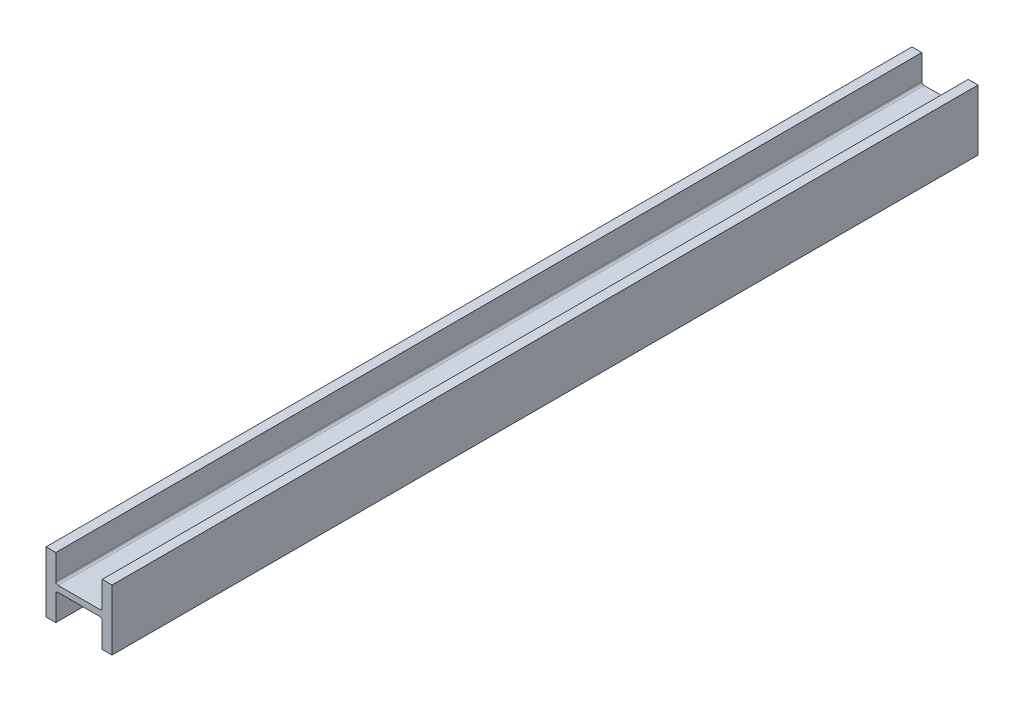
ISO-10303-21;
HEADER;
FILE_DESCRIPTION(('STEP AP214'),'2;1');
FILE_NAME('part.step','',(''),(''),'','','');
FILE_SCHEMA(('AUTOMOTIVE_DESIGN { 1 0 10303 214 1 1 1 1 }'));
ENDSEC;
DATA;
#1=APPLICATION_CONTEXT('core data for automotive mechanical design processes');
#2=APPLICATION_PROTOCOL_DEFINITION('international standard','automotive_design',2000,#1);
#3=PRODUCT_CONTEXT('',#1,'mechanical');
#4=PRODUCT('Part','Part','',(#3));
#5=PRODUCT_RELATED_PRODUCT_CATEGORY('part','',(#4));
#6=PRODUCT_DEFINITION_FORMATION('','',#4);
#7=PRODUCT_DEFINITION_CONTEXT('part definition',#1,'design');
#8=PRODUCT_DEFINITION('design','',#6,#7);
#9=PRODUCT_DEFINITION_SHAPE('','',#8);
#10=(LENGTH_UNIT() NAMED_UNIT(*) SI_UNIT(.MILLI.,.METRE.));
#11=(NAMED_UNIT(*) PLANE_ANGLE_UNIT() SI_UNIT($,.RADIAN.));
#12=(NAMED_UNIT(*) SI_UNIT($,.STERADIAN.) SOLID_ANGLE_UNIT());
#13=UNCERTAINTY_MEASURE_WITH_UNIT(LENGTH_MEASURE(1.E-05),#10,'distance_accuracy_value','');
#14=(GEOMETRIC_REPRESENTATION_CONTEXT(3) GLOBAL_UNCERTAINTY_ASSIGNED_CONTEXT((#13)) GLOBAL_UNIT_ASSIGNED_CONTEXT((#10,
#11,#12)) REPRESENTATION_CONTEXT('',''));
#15=CARTESIAN_POINT('',(0.,0.,0.));
#16=DIRECTION('',(0.,0.,1.));
#17=DIRECTION('',(1.,0.,0.));
#18=AXIS2_PLACEMENT_3D('',#15,#16,#17);
#19=CARTESIAN_POINT('',(227.584,209.2325,2984.5));
#20=DIRECTION('',(-1.,0.,0.));
#21=DIRECTION('',(0.,0.,1.));
#22=AXIS2_PLACEMENT_3D('',#19,#20,#21);
#23=PLANE('',#22);
#24=DIRECTION('',(0.,1.,0.));
#25=VECTOR('',#24,1.);
#26=CARTESIAN_POINT('',(227.584,209.2325,-2984.5));
#27=LINE('',#26,#25);
#28=CARTESIAN_POINT('',(227.584,-209.2325,-2984.5));
#29=VERTEX_POINT('',#28);
#30=CARTESIAN_POINT('',(227.584,209.2325,-2984.5));
#31=VERTEX_POINT('',#30);
#32=EDGE_CURVE('E193',#29,#31,#27,.T.);
#33=ORIENTED_EDGE('',*,*,#32,.T.);
#34=DIRECTION('',(0.,0.,-1.));
#35=VECTOR('',#34,1.);
#36=CARTESIAN_POINT('',(227.584,209.2325,2984.5));
#37=LINE('',#36,#35);
#38=CARTESIAN_POINT('',(227.584,209.2325,2984.5));
#39=VERTEX_POINT('',#38);
#40=EDGE_CURVE('E11',#39,#31,#37,.T.);
#41=ORIENTED_EDGE('',*,*,#40,.F.);
#42=DIRECTION('',(0.,1.,0.));
#43=VECTOR('',#42,1.);
#44=CARTESIAN_POINT('',(227.584,209.2325,2984.5));
#45=LINE('',#44,#43);
#46=CARTESIAN_POINT('',(227.584,-209.2325,2984.5));
#47=VERTEX_POINT('',#46);
#48=EDGE_CURVE('E238',#47,#39,#45,.T.);
#49=ORIENTED_EDGE('',*,*,#48,.F.);
#50=DIRECTION('',(0.,0.,-1.));
#51=VECTOR('',#50,1.);
#52=CARTESIAN_POINT('',(227.584,-209.2325,2984.5));
#53=LINE('',#52,#51);
#54=EDGE_CURVE('E190',#47,#29,#53,.T.);
#55=ORIENTED_EDGE('',*,*,#54,.T.);
#56=EDGE_LOOP('',(#33,#41,#49,#55));
#57=FACE_BOUND('',#56,.T.);
#58=ADVANCED_FACE('F44',(#57),#23,.F.);
#59=CARTESIAN_POINT('',(160.02,209.2325,2984.5));
#60=DIRECTION('',(0.,-1.,0.));
#61=DIRECTION('',(0.,0.,-1.));
#62=AXIS2_PLACEMENT_3D('',#59,#60,#61);
#63=PLANE('',#62);
#64=DIRECTION('',(-1.,0.,0.));
#65=VECTOR('',#64,1.);
#66=CARTESIAN_POINT('',(160.02,209.2325,-2984.5));
#67=LINE('',#66,#65);
#68=CARTESIAN_POINT('',(160.02,209.2325,-2984.5));
#69=VERTEX_POINT('',#68);
#70=EDGE_CURVE('E196',#31,#69,#67,.T.);
#71=ORIENTED_EDGE('',*,*,#70,.T.);
#72=DIRECTION('',(0.,0.,-1.));
#73=VECTOR('',#72,1.);
#74=CARTESIAN_POINT('',(160.02,209.2325,2984.5));
#75=LINE('',#74,#73);
#76=CARTESIAN_POINT('',(160.02,209.2325,2984.5));
#77=VERTEX_POINT('',#76);
#78=EDGE_CURVE('E53',#77,#69,#75,.T.);
#79=ORIENTED_EDGE('',*,*,#78,.F.);
#80=DIRECTION('',(-1.,0.,0.));
#81=VECTOR('',#80,1.);
#82=CARTESIAN_POINT('',(160.02,209.2325,2984.5));
#83=LINE('',#82,#81);
#84=EDGE_CURVE('E129',#39,#77,#83,.T.);
#85=ORIENTED_EDGE('',*,*,#84,.F.);
#86=ORIENTED_EDGE('',*,*,#40,.T.);
#87=EDGE_LOOP('',(#71,#79,#85,#86));
#88=FACE_BOUND('',#87,.T.);
#89=ADVANCED_FACE('F362',(#88),#63,.F.);
#90=CARTESIAN_POINT('',(160.02,36.2585000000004,2984.5));
#91=DIRECTION('',(1.,0.,0.));
#92=DIRECTION('',(0.,0.,-1.));
#93=AXIS2_PLACEMENT_3D('',#90,#91,#92);
#94=PLANE('',#93);
#95=DIRECTION('',(0.,-1.,0.));
#96=VECTOR('',#95,1.);
#97=CARTESIAN_POINT('',(160.02,36.2585000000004,-2984.5));
#98=LINE('',#97,#96);
#99=CARTESIAN_POINT('',(160.02,36.2585000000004,-2984.5));
#100=VERTEX_POINT('',#99);
#101=EDGE_CURVE('E203',#69,#100,#98,.T.);
#102=ORIENTED_EDGE('',*,*,#101,.T.);
#103=DIRECTION('',(0.,0.,-1.));
#104=VECTOR('',#103,1.);
#105=CARTESIAN_POINT('',(160.02,36.2585000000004,2984.5));
#106=LINE('',#105,#104);
#107=CARTESIAN_POINT('',(160.02,36.2585000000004,2984.5));
#108=VERTEX_POINT('',#107);
#109=EDGE_CURVE('E284',#108,#100,#106,.T.);
#110=ORIENTED_EDGE('',*,*,#109,.F.);
#111=DIRECTION('',(0.,-1.,0.));
#112=VECTOR('',#111,1.);
#113=CARTESIAN_POINT('',(160.02,36.2585000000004,2984.5));
#114=LINE('',#113,#112);
#115=EDGE_CURVE('E291',#77,#108,#114,.T.);
#116=ORIENTED_EDGE('',*,*,#115,.F.);
#117=ORIENTED_EDGE('',*,*,#78,.T.);
#118=EDGE_LOOP('',(#102,#110,#116,#117));
#119=FACE_BOUND('',#118,.T.);
#120=ADVANCED_FACE('F292',(#119),#94,.F.);
#121=CARTESIAN_POINT('',(144.78,36.2585000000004,2984.5));
#122=DIRECTION('',(0.,0.,-1.));
#123=DIRECTION('',(-1.,0.,0.));
#124=AXIS2_PLACEMENT_3D('',#121,#122,#123);
#125=CYLINDRICAL_SURFACE('',#124,15.24);
#126=CARTESIAN_POINT('',(144.78,36.2585000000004,-2984.5));
#127=DIRECTION('',(0.,0.,-1.));
#128=DIRECTION('',(1.,0.,0.));
#129=AXIS2_PLACEMENT_3D('',#126,#127,#128);
#130=CIRCLE('',#129,15.24);
#131=CARTESIAN_POINT('',(144.78,21.0185000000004,-2984.5));
#132=VERTEX_POINT('',#131);
#133=EDGE_CURVE('E204',#100,#132,#130,.T.);
#134=ORIENTED_EDGE('',*,*,#133,.T.);
#135=DIRECTION('',(0.,0.,-1.));
#136=VECTOR('',#135,1.);
#137=CARTESIAN_POINT('',(144.78,21.0185000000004,2984.5));
#138=LINE('',#137,#136);
#139=CARTESIAN_POINT('',(144.78,21.0185000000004,2984.5));
#140=VERTEX_POINT('',#139);
#141=EDGE_CURVE('E276',#140,#132,#138,.T.);
#142=ORIENTED_EDGE('',*,*,#141,.F.);
#143=CARTESIAN_POINT('',(144.78,36.2585000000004,2984.5));
#144=DIRECTION('',(0.,0.,-1.));
#145=DIRECTION('',(1.,0.,0.));
#146=AXIS2_PLACEMENT_3D('',#143,#144,#145);
#147=CIRCLE('',#146,15.24);
#148=EDGE_CURVE('E315',#108,#140,#147,.T.);
#149=ORIENTED_EDGE('',*,*,#148,.F.);
#150=ORIENTED_EDGE('',*,*,#109,.T.);
#151=EDGE_LOOP('',(#134,#142,#149,#150));
#152=FACE_BOUND('',#151,.T.);
#153=ADVANCED_FACE('F301',(#152),#125,.F.);
#154=CARTESIAN_POINT('',(-144.78,21.0185000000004,2984.5));
#155=DIRECTION('',(0.,-1.,0.));
#156=DIRECTION('',(0.,0.,-1.));
#157=AXIS2_PLACEMENT_3D('',#154,#155,#156);
#158=PLANE('',#157);
#159=DIRECTION('',(-1.,0.,0.));
#160=VECTOR('',#159,1.);
#161=CARTESIAN_POINT('',(-144.78,21.0185000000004,-2984.5));
#162=LINE('',#161,#160);
#163=CARTESIAN_POINT('',(-144.78,21.0185000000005,-2984.5));
#164=VERTEX_POINT('',#163);
#165=EDGE_CURVE('E210',#132,#164,#162,.T.);
#166=ORIENTED_EDGE('',*,*,#165,.T.);
#167=DIRECTION('',(0.,0.,-1.));
#168=VECTOR('',#167,1.);
#169=CARTESIAN_POINT('',(-144.78,21.0185000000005,2984.5));
#170=LINE('',#169,#168);
#171=CARTESIAN_POINT('',(-144.78,21.0185000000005,2984.5));
#172=VERTEX_POINT('',#171);
#173=EDGE_CURVE('E274',#172,#164,#170,.T.);
#174=ORIENTED_EDGE('',*,*,#173,.F.);
#175=DIRECTION('',(-1.,0.,0.));
#176=VECTOR('',#175,1.);
#177=CARTESIAN_POINT('',(-144.78,21.0185000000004,2984.5));
#178=LINE('',#177,#176);
#179=EDGE_CURVE('E306',#140,#172,#178,.T.);
#180=ORIENTED_EDGE('',*,*,#179,.F.);
#181=ORIENTED_EDGE('',*,*,#141,.T.);
#182=EDGE_LOOP('',(#166,#174,#180,#181));
#183=FACE_BOUND('',#182,.T.);
#184=ADVANCED_FACE('F308',(#183),#158,.F.);
#185=CARTESIAN_POINT('',(-144.78,36.2585000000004,2984.5));
#186=DIRECTION('',(0.,0.,-1.));
#187=DIRECTION('',(-1.,0.,0.));
#188=AXIS2_PLACEMENT_3D('',#185,#186,#187);
#189=CYLINDRICAL_SURFACE('',#188,15.24);
#190=CARTESIAN_POINT('',(-144.78,36.2585000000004,-2984.5));
#191=DIRECTION('',(0.,0.,-1.));
#192=DIRECTION('',(1.,0.,0.));
#193=AXIS2_PLACEMENT_3D('',#190,#191,#192);
#194=CIRCLE('',#193,15.24);
#195=CARTESIAN_POINT('',(-160.02,36.2585000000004,-2984.5));
#196=VERTEX_POINT('',#195);
#197=EDGE_CURVE('E209',#164,#196,#194,.T.);
#198=ORIENTED_EDGE('',*,*,#197,.T.);
#199=DIRECTION('',(0.,0.,-1.));
#200=VECTOR('',#199,1.);
#201=CARTESIAN_POINT('',(-160.02,36.2585000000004,2984.5));
#202=LINE('',#201,#200);
#203=CARTESIAN_POINT('',(-160.02,36.2585000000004,2984.5));
#204=VERTEX_POINT('',#203);
#205=EDGE_CURVE('E271',#204,#196,#202,.T.);
#206=ORIENTED_EDGE('',*,*,#205,.F.);
#207=CARTESIAN_POINT('',(-144.78,36.2585000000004,2984.5));
#208=DIRECTION('',(0.,0.,-1.));
#209=DIRECTION('',(1.,0.,0.));
#210=AXIS2_PLACEMENT_3D('',#207,#208,#209);
#211=CIRCLE('',#210,15.24);
#212=EDGE_CURVE('E313',#172,#204,#211,.T.);
#213=ORIENTED_EDGE('',*,*,#212,.F.);
#214=ORIENTED_EDGE('',*,*,#173,.T.);
#215=EDGE_LOOP('',(#198,#206,#213,#214));
#216=FACE_BOUND('',#215,.T.);
#217=ADVANCED_FACE('F374',(#216),#189,.F.);
#218=CARTESIAN_POINT('',(-160.02,209.2325,2984.5));
#219=DIRECTION('',(-1.,0.,0.));
#220=DIRECTION('',(0.,0.,1.));
#221=AXIS2_PLACEMENT_3D('',#218,#219,#220);
#222=PLANE('',#221);
#223=DIRECTION('',(0.,1.,0.));
#224=VECTOR('',#223,1.);
#225=CARTESIAN_POINT('',(-160.02,209.2325,-2984.5));
#226=LINE('',#225,#224);
#227=CARTESIAN_POINT('',(-160.02,209.2325,-2984.5));
#228=VERTEX_POINT('',#227);
#229=EDGE_CURVE('E213',#196,#228,#226,.T.);
#230=ORIENTED_EDGE('',*,*,#229,.T.);
#231=DIRECTION('',(0.,0.,-1.));
#232=VECTOR('',#231,1.);
#233=CARTESIAN_POINT('',(-160.02,209.2325,2984.5));
#234=LINE('',#233,#232);
#235=CARTESIAN_POINT('',(-160.02,209.2325,2984.5));
#236=VERTEX_POINT('',#235);
#237=EDGE_CURVE('E270',#236,#228,#234,.T.);
#238=ORIENTED_EDGE('',*,*,#237,.F.);
#239=DIRECTION('',(0.,1.,0.));
#240=VECTOR('',#239,1.);
#241=CARTESIAN_POINT('',(-160.02,209.2325,2984.5));
#242=LINE('',#241,#240);
#243=EDGE_CURVE('E316',#204,#236,#242,.T.);
#244=ORIENTED_EDGE('',*,*,#243,.F.);
#245=ORIENTED_EDGE('',*,*,#205,.T.);
#246=EDGE_LOOP('',(#230,#238,#244,#245));
#247=FACE_BOUND('',#246,.T.);
#248=ADVANCED_FACE('F378',(#247),#222,.F.);
#249=CARTESIAN_POINT('',(-227.584,209.2325,2984.5));
#250=DIRECTION('',(0.,-1.,0.));
#251=DIRECTION('',(0.,0.,-1.));
#252=AXIS2_PLACEMENT_3D('',#249,#250,#251);
#253=PLANE('',#252);
#254=DIRECTION('',(-1.,0.,0.));
#255=VECTOR('',#254,1.);
#256=CARTESIAN_POINT('',(-227.584,209.2325,-2984.5));
#257=LINE('',#256,#255);
#258=CARTESIAN_POINT('',(-227.584,209.2325,-2984.5));
#259=VERTEX_POINT('',#258);
#260=EDGE_CURVE('E216',#228,#259,#257,.T.);
#261=ORIENTED_EDGE('',*,*,#260,.T.);
#262=DIRECTION('',(0.,0.,-1.));
#263=VECTOR('',#262,1.);
#264=CARTESIAN_POINT('',(-227.584,209.2325,2984.5));
#265=LINE('',#264,#263);
#266=CARTESIAN_POINT('',(-227.584,209.2325,2984.5));
#267=VERTEX_POINT('',#266);
#268=EDGE_CURVE('E263',#267,#259,#265,.T.);
#269=ORIENTED_EDGE('',*,*,#268,.F.);
#270=DIRECTION('',(-1.,0.,0.));
#271=VECTOR('',#270,1.);
#272=CARTESIAN_POINT('',(-227.584,209.2325,2984.5));
#273=LINE('',#272,#271);
#274=EDGE_CURVE('E323',#236,#267,#273,.T.);
#275=ORIENTED_EDGE('',*,*,#274,.F.);
#276=ORIENTED_EDGE('',*,*,#237,.T.);
#277=EDGE_LOOP('',(#261,#269,#275,#276));
#278=FACE_BOUND('',#277,.T.);
#279=ADVANCED_FACE('F385',(#278),#253,.F.);
#280=CARTESIAN_POINT('',(-227.584,-209.2325,2984.5));
#281=DIRECTION('',(1.,0.,0.));
#282=DIRECTION('',(0.,0.,-1.));
#283=AXIS2_PLACEMENT_3D('',#280,#281,#282);
#284=PLANE('',#283);
#285=DIRECTION('',(0.,-1.,0.));
#286=VECTOR('',#285,1.);
#287=CARTESIAN_POINT('',(-227.584,-209.2325,-2984.5));
#288=LINE('',#287,#286);
#289=CARTESIAN_POINT('',(-227.584,-209.2325,-2984.5));
#290=VERTEX_POINT('',#289);
#291=EDGE_CURVE('E218',#259,#290,#288,.T.);
#292=ORIENTED_EDGE('',*,*,#291,.T.);
#293=DIRECTION('',(0.,0.,-1.));
#294=VECTOR('',#293,1.);
#295=CARTESIAN_POINT('',(-227.584,-209.2325,2984.5));
#296=LINE('',#295,#294);
#297=CARTESIAN_POINT('',(-227.584,-209.2325,2984.5));
#298=VERTEX_POINT('',#297);
#299=EDGE_CURVE('E259',#298,#290,#296,.T.);
#300=ORIENTED_EDGE('',*,*,#299,.F.);
#301=DIRECTION('',(0.,-1.,0.));
#302=VECTOR('',#301,1.);
#303=CARTESIAN_POINT('',(-227.584,-209.2325,2984.5));
#304=LINE('',#303,#302);
#305=EDGE_CURVE('E326',#267,#298,#304,.T.);
#306=ORIENTED_EDGE('',*,*,#305,.F.);
#307=ORIENTED_EDGE('',*,*,#268,.T.);
#308=EDGE_LOOP('',(#292,#300,#306,#307));
#309=FACE_BOUND('',#308,.T.);
#310=ADVANCED_FACE('F387',(#309),#284,.F.);
#311=CARTESIAN_POINT('',(-160.02,-209.2325,2984.5));
#312=DIRECTION('',(0.,1.,0.));
#313=DIRECTION('',(0.,0.,1.));
#314=AXIS2_PLACEMENT_3D('',#311,#312,#313);
#315=PLANE('',#314);
#316=DIRECTION('',(1.,0.,0.));
#317=VECTOR('',#316,1.);
#318=CARTESIAN_POINT('',(-160.02,-209.2325,-2984.5));
#319=LINE('',#318,#317);
#320=CARTESIAN_POINT('',(-160.02,-209.2325,-2984.5));
#321=VERTEX_POINT('',#320);
#322=EDGE_CURVE('E225',#290,#321,#319,.T.);
#323=ORIENTED_EDGE('',*,*,#322,.T.);
#324=DIRECTION('',(0.,0.,-1.));
#325=VECTOR('',#324,1.);
#326=CARTESIAN_POINT('',(-160.02,-209.2325,2984.5));
#327=LINE('',#326,#325);
#328=CARTESIAN_POINT('',(-160.02,-209.2325,2984.5));
#329=VERTEX_POINT('',#328);
#330=EDGE_CURVE('E254',#329,#321,#327,.T.);
#331=ORIENTED_EDGE('',*,*,#330,.F.);
#332=DIRECTION('',(1.,0.,0.));
#333=VECTOR('',#332,1.);
#334=CARTESIAN_POINT('',(-160.02,-209.2325,2984.5));
#335=LINE('',#334,#333);
#336=EDGE_CURVE('E328',#298,#329,#335,.T.);
#337=ORIENTED_EDGE('',*,*,#336,.F.);
#338=ORIENTED_EDGE('',*,*,#299,.T.);
#339=EDGE_LOOP('',(#323,#331,#337,#338));
#340=FACE_BOUND('',#339,.T.);
#341=ADVANCED_FACE('F388',(#340),#315,.F.);
#342=CARTESIAN_POINT('',(-160.02,-36.2584999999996,2984.5));
#343=DIRECTION('',(-1.,0.,0.));
#344=DIRECTION('',(0.,0.,1.));
#345=AXIS2_PLACEMENT_3D('',#342,#343,#344);
#346=PLANE('',#345);
#347=DIRECTION('',(0.,1.,0.));
#348=VECTOR('',#347,1.);
#349=CARTESIAN_POINT('',(-160.02,-36.2584999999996,-2984.5));
#350=LINE('',#349,#348);
#351=CARTESIAN_POINT('',(-160.02,-36.2584999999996,-2984.5));
#352=VERTEX_POINT('',#351);
#353=EDGE_CURVE('E223',#321,#352,#350,.T.);
#354=ORIENTED_EDGE('',*,*,#353,.T.);
#355=DIRECTION('',(0.,0.,-1.));
#356=VECTOR('',#355,1.);
#357=CARTESIAN_POINT('',(-160.02,-36.2584999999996,2984.5));
#358=LINE('',#357,#356);
#359=CARTESIAN_POINT('',(-160.02,-36.2584999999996,2984.5));
#360=VERTEX_POINT('',#359);
#361=EDGE_CURVE('E253',#360,#352,#358,.T.);
#362=ORIENTED_EDGE('',*,*,#361,.F.);
#363=DIRECTION('',(0.,1.,0.));
#364=VECTOR('',#363,1.);
#365=CARTESIAN_POINT('',(-160.02,-36.2584999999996,2984.5));
#366=LINE('',#365,#364);
#367=EDGE_CURVE('E335',#329,#360,#366,.T.);
#368=ORIENTED_EDGE('',*,*,#367,.F.);
#369=ORIENTED_EDGE('',*,*,#330,.T.);
#370=EDGE_LOOP('',(#354,#362,#368,#369));
#371=FACE_BOUND('',#370,.T.);
#372=ADVANCED_FACE('F393',(#371),#346,.F.);
#373=CARTESIAN_POINT('',(-144.78,-36.2584999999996,2984.5));
#374=DIRECTION('',(0.,0.,-1.));
#375=DIRECTION('',(-1.,0.,0.));
#376=AXIS2_PLACEMENT_3D('',#373,#374,#375);
#377=CYLINDRICAL_SURFACE('',#376,15.24);
#378=CARTESIAN_POINT('',(-144.78,-36.2584999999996,-2984.5));
#379=DIRECTION('',(0.,0.,-1.));
#380=DIRECTION('',(1.,0.,0.));
#381=AXIS2_PLACEMENT_3D('',#378,#379,#380);
#382=CIRCLE('',#381,15.24);
#383=CARTESIAN_POINT('',(-144.78,-21.0184999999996,-2984.5));
#384=VERTEX_POINT('',#383);
#385=EDGE_CURVE('E229',#352,#384,#382,.T.);
#386=ORIENTED_EDGE('',*,*,#385,.T.);
#387=DIRECTION('',(0.,0.,-1.));
#388=VECTOR('',#387,1.);
#389=CARTESIAN_POINT('',(-144.78,-21.0184999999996,2984.5));
#390=LINE('',#389,#388);
#391=CARTESIAN_POINT('',(-144.78,-21.0184999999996,2984.5));
#392=VERTEX_POINT('',#391);
#393=EDGE_CURVE('E246',#392,#384,#390,.T.);
#394=ORIENTED_EDGE('',*,*,#393,.F.);
#395=CARTESIAN_POINT('',(-144.78,-36.2584999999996,2984.5));
#396=DIRECTION('',(0.,0.,-1.));
#397=DIRECTION('',(1.,0.,0.));
#398=AXIS2_PLACEMENT_3D('',#395,#396,#397);
#399=CIRCLE('',#398,15.24);
#400=EDGE_CURVE('E333',#360,#392,#399,.T.);
#401=ORIENTED_EDGE('',*,*,#400,.F.);
#402=ORIENTED_EDGE('',*,*,#361,.T.);
#403=EDGE_LOOP('',(#386,#394,#401,#402));
#404=FACE_BOUND('',#403,.T.);
#405=ADVANCED_FACE('F345',(#404),#377,.F.);
#406=CARTESIAN_POINT('',(144.78,-21.0184999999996,2984.5));
#407=DIRECTION('',(0.,1.,0.));
#408=DIRECTION('',(-1.,0.,0.));
#409=AXIS2_PLACEMENT_3D('',#406,#407,#408);
#410=PLANE('',#409);
#411=DIRECTION('',(1.,0.,0.));
#412=VECTOR('',#411,1.);
#413=CARTESIAN_POINT('',(144.78,-21.0184999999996,-2984.5));
#414=LINE('',#413,#412);
#415=CARTESIAN_POINT('',(144.78,-21.0184999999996,-2984.5));
#416=VERTEX_POINT('',#415);
#417=EDGE_CURVE('E234',#384,#416,#414,.T.);
#418=ORIENTED_EDGE('',*,*,#417,.T.);
#419=DIRECTION('',(0.,0.,-1.));
#420=VECTOR('',#419,1.);
#421=CARTESIAN_POINT('',(144.78,-21.0184999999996,2984.5));
#422=LINE('',#421,#420);
#423=CARTESIAN_POINT('',(144.78,-21.0184999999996,2984.5));
#424=VERTEX_POINT('',#423);
#425=EDGE_CURVE('E181',#424,#416,#422,.T.);
#426=ORIENTED_EDGE('',*,*,#425,.F.);
#427=DIRECTION('',(1.,0.,0.));
#428=VECTOR('',#427,1.);
#429=CARTESIAN_POINT('',(144.78,-21.0184999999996,2984.5));
#430=LINE('',#429,#428);
#431=EDGE_CURVE('E172',#392,#424,#430,.T.);
#432=ORIENTED_EDGE('',*,*,#431,.F.);
#433=ORIENTED_EDGE('',*,*,#393,.T.);
#434=EDGE_LOOP('',(#418,#426,#432,#433));
#435=FACE_BOUND('',#434,.T.);
#436=ADVANCED_FACE('F350',(#435),#410,.F.);
#437=CARTESIAN_POINT('',(144.78,-36.2584999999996,2984.5));
#438=DIRECTION('',(0.,0.,-1.));
#439=DIRECTION('',(-1.,0.,0.));
#440=AXIS2_PLACEMENT_3D('',#437,#438,#439);
#441=CYLINDRICAL_SURFACE('',#440,15.24);
#442=CARTESIAN_POINT('',(144.78,-36.2584999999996,-2984.5));
#443=DIRECTION('',(0.,0.,-1.));
#444=DIRECTION('',(1.,0.,0.));
#445=AXIS2_PLACEMENT_3D('',#442,#443,#444);
#446=CIRCLE('',#445,15.24);
#447=CARTESIAN_POINT('',(160.02,-36.2584999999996,-2984.5));
#448=VERTEX_POINT('',#447);
#449=EDGE_CURVE('E182',#416,#448,#446,.T.);
#450=ORIENTED_EDGE('',*,*,#449,.T.);
#451=DIRECTION('',(0.,0.,-1.));
#452=VECTOR('',#451,1.);
#453=CARTESIAN_POINT('',(160.02,-36.2584999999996,2984.5));
#454=LINE('',#453,#452);
#455=CARTESIAN_POINT('',(160.02,-36.2584999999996,2984.5));
#456=VERTEX_POINT('',#455);
#457=EDGE_CURVE('E180',#456,#448,#454,.T.);
#458=ORIENTED_EDGE('',*,*,#457,.F.);
#459=CARTESIAN_POINT('',(144.78,-36.2584999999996,2984.5));
#460=DIRECTION('',(0.,0.,-1.));
#461=DIRECTION('',(1.,0.,0.));
#462=AXIS2_PLACEMENT_3D('',#459,#460,#461);
#463=CIRCLE('',#462,15.24);
#464=EDGE_CURVE('E167',#424,#456,#463,.T.);
#465=ORIENTED_EDGE('',*,*,#464,.F.);
#466=ORIENTED_EDGE('',*,*,#425,.T.);
#467=EDGE_LOOP('',(#450,#458,#465,#466));
#468=FACE_BOUND('',#467,.T.);
#469=ADVANCED_FACE('F178',(#468),#441,.F.);
#470=CARTESIAN_POINT('',(160.02,-209.2325,2984.5));
#471=DIRECTION('',(1.,0.,0.));
#472=DIRECTION('',(0.,0.,-1.));
#473=AXIS2_PLACEMENT_3D('',#470,#471,#472);
#474=PLANE('',#473);
#475=DIRECTION('',(0.,-1.,0.));
#476=VECTOR('',#475,1.);
#477=CARTESIAN_POINT('',(160.02,-209.2325,-2984.5));
#478=LINE('',#477,#476);
#479=CARTESIAN_POINT('',(160.02,-209.2325,-2984.5));
#480=VERTEX_POINT('',#479);
#481=EDGE_CURVE('E113',#448,#480,#478,.T.);
#482=ORIENTED_EDGE('',*,*,#481,.T.);
#483=DIRECTION('',(0.,0.,-1.));
#484=VECTOR('',#483,1.);
#485=CARTESIAN_POINT('',(160.02,-209.2325,2984.5));
#486=LINE('',#485,#484);
#487=CARTESIAN_POINT('',(160.02,-209.2325,2984.5));
#488=VERTEX_POINT('',#487);
#489=EDGE_CURVE('E184',#488,#480,#486,.T.);
#490=ORIENTED_EDGE('',*,*,#489,.F.);
#491=DIRECTION('',(0.,-1.,0.));
#492=VECTOR('',#491,1.);
#493=CARTESIAN_POINT('',(160.02,-209.2325,2984.5));
#494=LINE('',#493,#492);
#495=EDGE_CURVE('E168',#456,#488,#494,.T.);
#496=ORIENTED_EDGE('',*,*,#495,.F.);
#497=ORIENTED_EDGE('',*,*,#457,.T.);
#498=EDGE_LOOP('',(#482,#490,#496,#497));
#499=FACE_BOUND('',#498,.T.);
#500=ADVANCED_FACE('F186',(#499),#474,.F.);
#501=CARTESIAN_POINT('',(227.584,-209.2325,2984.5));
#502=DIRECTION('',(0.,1.,0.));
#503=DIRECTION('',(0.,0.,1.));
#504=AXIS2_PLACEMENT_3D('',#501,#502,#503);
#505=PLANE('',#504);
#506=DIRECTION('',(1.,0.,0.));
#507=VECTOR('',#506,1.);
#508=CARTESIAN_POINT('',(227.584,-209.2325,-2984.5));
#509=LINE('',#508,#507);
#510=EDGE_CURVE('E124',#480,#29,#509,.T.);
#511=ORIENTED_EDGE('',*,*,#510,.T.);
#512=ORIENTED_EDGE('',*,*,#54,.F.);
#513=DIRECTION('',(1.,0.,0.));
#514=VECTOR('',#513,1.);
#515=CARTESIAN_POINT('',(227.584,-209.2325,2984.5));
#516=LINE('',#515,#514);
#517=EDGE_CURVE('E62',#488,#47,#516,.T.);
#518=ORIENTED_EDGE('',*,*,#517,.F.);
#519=ORIENTED_EDGE('',*,*,#489,.T.);
#520=EDGE_LOOP('',(#511,#512,#518,#519));
#521=FACE_BOUND('',#520,.T.);
#522=ADVANCED_FACE('F351',(#521),#505,.F.);
#523=CARTESIAN_POINT('',(144.78,-36.2584999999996,2984.5));
#524=DIRECTION('',(0.,0.,1.));
#525=DIRECTION('',(1.,0.,0.));
#526=AXIS2_PLACEMENT_3D('',#523,#524,#525);
#527=PLANE('',#526);
#528=ORIENTED_EDGE('',*,*,#48,.T.);
#529=ORIENTED_EDGE('',*,*,#84,.T.);
#530=ORIENTED_EDGE('',*,*,#115,.T.);
#531=ORIENTED_EDGE('',*,*,#148,.T.);
#532=ORIENTED_EDGE('',*,*,#179,.T.);
#533=ORIENTED_EDGE('',*,*,#212,.T.);
#534=ORIENTED_EDGE('',*,*,#243,.T.);
#535=ORIENTED_EDGE('',*,*,#274,.T.);
#536=ORIENTED_EDGE('',*,*,#305,.T.);
#537=ORIENTED_EDGE('',*,*,#336,.T.);
#538=ORIENTED_EDGE('',*,*,#367,.T.);
#539=ORIENTED_EDGE('',*,*,#400,.T.);
#540=ORIENTED_EDGE('',*,*,#431,.T.);
#541=ORIENTED_EDGE('',*,*,#464,.T.);
#542=ORIENTED_EDGE('',*,*,#495,.T.);
#543=ORIENTED_EDGE('',*,*,#517,.T.);
#544=EDGE_LOOP('',(#528,#529,#530,#531,#532,#533,#534,#535,#536,#537,#538,#539,#540,#541,#542,#543));
#545=FACE_BOUND('',#544,.T.);
#546=ADVANCED_FACE('F169',(#545),#527,.T.);
#547=CARTESIAN_POINT('',(144.78,-36.2584999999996,-2984.5));
#548=DIRECTION('',(0.,0.,1.));
#549=DIRECTION('',(1.,0.,0.));
#550=AXIS2_PLACEMENT_3D('',#547,#548,#549);
#551=PLANE('',#550);
#552=ORIENTED_EDGE('',*,*,#32,.F.);
#553=ORIENTED_EDGE('',*,*,#510,.F.);
#554=ORIENTED_EDGE('',*,*,#481,.F.);
#555=ORIENTED_EDGE('',*,*,#449,.F.);
#556=ORIENTED_EDGE('',*,*,#417,.F.);
#557=ORIENTED_EDGE('',*,*,#385,.F.);
#558=ORIENTED_EDGE('',*,*,#353,.F.);
#559=ORIENTED_EDGE('',*,*,#322,.F.);
#560=ORIENTED_EDGE('',*,*,#291,.F.);
#561=ORIENTED_EDGE('',*,*,#260,.F.);
#562=ORIENTED_EDGE('',*,*,#229,.F.);
#563=ORIENTED_EDGE('',*,*,#197,.F.);
#564=ORIENTED_EDGE('',*,*,#165,.F.);
#565=ORIENTED_EDGE('',*,*,#133,.F.);
#566=ORIENTED_EDGE('',*,*,#101,.F.);
#567=ORIENTED_EDGE('',*,*,#70,.F.);
#568=EDGE_LOOP('',(#552,#553,#554,#555,#556,#557,#558,#559,#560,#561,#562,#563,#564,#565,#566,#567));
#569=FACE_BOUND('',#568,.T.);
#570=ADVANCED_FACE('F297',(#569),#551,.F.);
#571=CLOSED_SHELL('',(#58,#89,#120,#153,#184,#217,#248,#279,#310,#341,#372,#405,#436,#469,#500,
#522,#546,#570));
#572=MANIFOLD_SOLID_BREP('B2',#571);
#573=ADVANCED_BREP_SHAPE_REPRESENTATION('',(#18,#572),#14);
#574=SHAPE_DEFINITION_REPRESENTATION(#9,#573);
ENDSEC;
END-ISO-10303-21;
